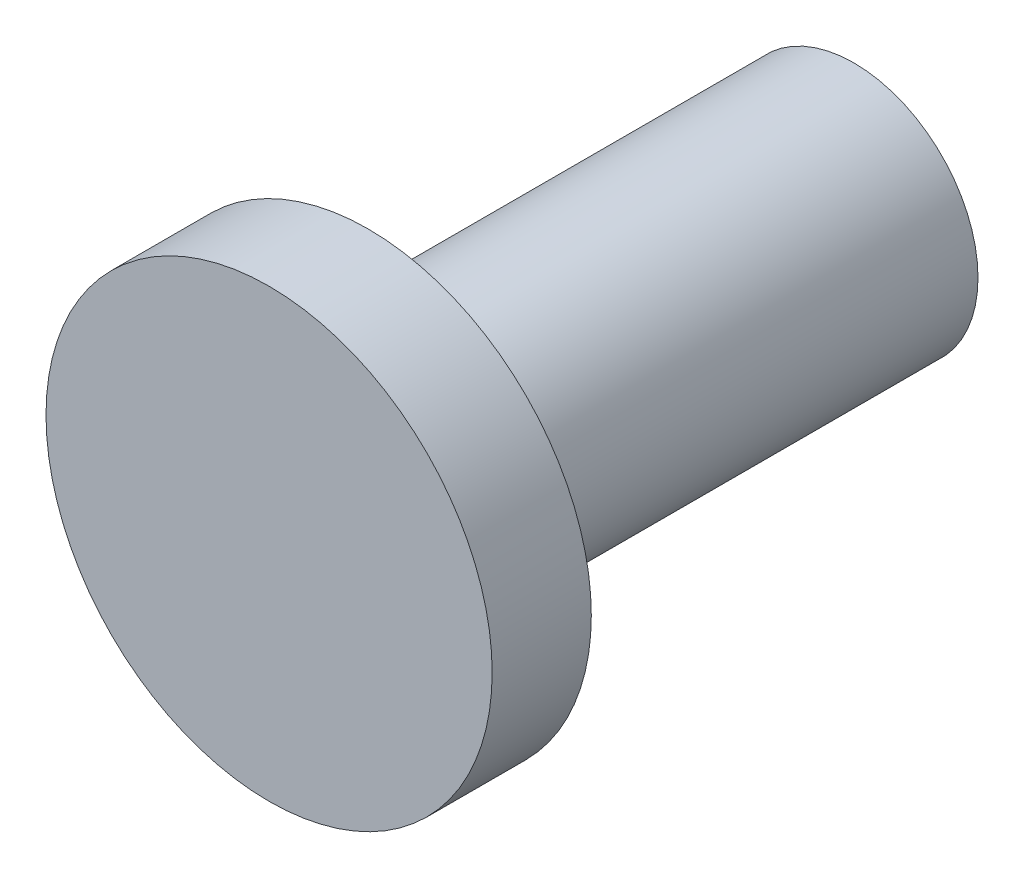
ISO-10303-21;
HEADER;
FILE_DESCRIPTION(('STEP AP214'),'2;1');
FILE_NAME('part.step','',(''),(''),'','','');
FILE_SCHEMA(('AUTOMOTIVE_DESIGN { 1 0 10303 214 1 1 1 1 }'));
ENDSEC;
DATA;
#1=APPLICATION_CONTEXT('core data for automotive mechanical design processes');
#2=APPLICATION_PROTOCOL_DEFINITION('international standard','automotive_design',2000,#1);
#3=PRODUCT_CONTEXT('',#1,'mechanical');
#4=PRODUCT('Part','Part','',(#3));
#5=PRODUCT_RELATED_PRODUCT_CATEGORY('part','',(#4));
#6=PRODUCT_DEFINITION_FORMATION('','',#4);
#7=PRODUCT_DEFINITION_CONTEXT('part definition',#1,'design');
#8=PRODUCT_DEFINITION('design','',#6,#7);
#9=PRODUCT_DEFINITION_SHAPE('','',#8);
#10=(LENGTH_UNIT() NAMED_UNIT(*) SI_UNIT(.MILLI.,.METRE.));
#11=(NAMED_UNIT(*) PLANE_ANGLE_UNIT() SI_UNIT($,.RADIAN.));
#12=(NAMED_UNIT(*) SI_UNIT($,.STERADIAN.) SOLID_ANGLE_UNIT());
#13=UNCERTAINTY_MEASURE_WITH_UNIT(LENGTH_MEASURE(1.E-05),#10,'distance_accuracy_value','');
#14=(GEOMETRIC_REPRESENTATION_CONTEXT(3) GLOBAL_UNCERTAINTY_ASSIGNED_CONTEXT((#13)) GLOBAL_UNIT_ASSIGNED_CONTEXT((#10,
#11,#12)) REPRESENTATION_CONTEXT('',''));
#15=CARTESIAN_POINT('',(0.,0.,0.));
#16=DIRECTION('',(0.,0.,1.));
#17=DIRECTION('',(1.,0.,0.));
#18=AXIS2_PLACEMENT_3D('',#15,#16,#17);
#19=CARTESIAN_POINT('',(0.,0.,-49.));
#20=DIRECTION('',(0.,0.,-1.));
#21=DIRECTION('',(0.,1.,0.));
#22=AXIS2_PLACEMENT_3D('',#19,#20,#21);
#23=PLANE('',#22);
#24=CARTESIAN_POINT('',(0.,0.,-49.));
#25=DIRECTION('',(0.,0.,-1.));
#26=DIRECTION('',(0.,1.,0.));
#27=AXIS2_PLACEMENT_3D('',#24,#25,#26);
#28=CIRCLE('',#27,12.5);
#29=CARTESIAN_POINT('',(0.,12.5,-49.));
#30=VERTEX_POINT('',#29);
#31=EDGE_CURVE('E8',#30,#30,#28,.T.);
#32=ORIENTED_EDGE('',*,*,#31,.T.);
#33=EDGE_LOOP('',(#32));
#34=FACE_BOUND('',#33,.T.);
#35=ADVANCED_FACE('F12',(#34),#23,.T.);
#36=CARTESIAN_POINT('',(0.,0.,-59.));
#37=DIRECTION('',(0.,0.,-1.));
#38=DIRECTION('',(0.,1.,0.));
#39=AXIS2_PLACEMENT_3D('',#36,#37,#38);
#40=CYLINDRICAL_SURFACE('',#39,12.5);
#41=CARTESIAN_POINT('',(0.,0.,0.));
#42=DIRECTION('',(0.,0.,-1.));
#43=DIRECTION('',(0.,1.,0.));
#44=AXIS2_PLACEMENT_3D('',#41,#42,#43);
#45=CIRCLE('',#44,12.5);
#46=CARTESIAN_POINT('',(0.,12.5,0.));
#47=VERTEX_POINT('',#46);
#48=EDGE_CURVE('E18',#47,#47,#45,.T.);
#49=ORIENTED_EDGE('',*,*,#48,.T.);
#50=EDGE_LOOP('',(#49));
#51=FACE_BOUND('',#50,.T.);
#52=ORIENTED_EDGE('',*,*,#31,.F.);
#53=EDGE_LOOP('',(#52));
#54=FACE_BOUND('',#53,.T.);
#55=ADVANCED_FACE('F45',(#51,#54),#40,.T.);
#56=CARTESIAN_POINT('',(12.5,0.,0.));
#57=DIRECTION('',(0.,0.,-1.));
#58=DIRECTION('',(0.,1.,0.));
#59=AXIS2_PLACEMENT_3D('',#56,#57,#58);
#60=PLANE('',#59);
#61=CARTESIAN_POINT('',(0.,0.,0.));
#62=DIRECTION('',(0.,0.,-1.));
#63=DIRECTION('',(0.,1.,0.));
#64=AXIS2_PLACEMENT_3D('',#61,#62,#63);
#65=CIRCLE('',#64,22.5);
#66=CARTESIAN_POINT('',(0.,22.5,0.));
#67=VERTEX_POINT('',#66);
#68=EDGE_CURVE('E22',#67,#67,#65,.T.);
#69=ORIENTED_EDGE('',*,*,#68,.T.);
#70=EDGE_LOOP('',(#69));
#71=FACE_BOUND('',#70,.T.);
#72=ORIENTED_EDGE('',*,*,#48,.F.);
#73=EDGE_LOOP('',(#72));
#74=FACE_BOUND('',#73,.T.);
#75=ADVANCED_FACE('F42',(#71,#74),#60,.T.);
#76=CARTESIAN_POINT('',(0.,0.,-59.));
#77=DIRECTION('',(0.,0.,-1.));
#78=DIRECTION('',(0.,1.,0.));
#79=AXIS2_PLACEMENT_3D('',#76,#77,#78);
#80=CYLINDRICAL_SURFACE('',#79,22.5);
#81=CARTESIAN_POINT('',(0.,0.,10.));
#82=DIRECTION('',(0.,0.,-1.));
#83=DIRECTION('',(0.,1.,0.));
#84=AXIS2_PLACEMENT_3D('',#81,#82,#83);
#85=CIRCLE('',#84,22.5);
#86=CARTESIAN_POINT('',(0.,22.5,10.));
#87=VERTEX_POINT('',#86);
#88=EDGE_CURVE('E26',#87,#87,#85,.T.);
#89=ORIENTED_EDGE('',*,*,#88,.T.);
#90=EDGE_LOOP('',(#89));
#91=FACE_BOUND('',#90,.T.);
#92=ORIENTED_EDGE('',*,*,#68,.F.);
#93=EDGE_LOOP('',(#92));
#94=FACE_BOUND('',#93,.T.);
#95=ADVANCED_FACE('F32',(#91,#94),#80,.T.);
#96=CARTESIAN_POINT('',(22.5,0.,10.));
#97=DIRECTION('',(0.,0.,1.));
#98=DIRECTION('',(0.,-1.,0.));
#99=AXIS2_PLACEMENT_3D('',#96,#97,#98);
#100=PLANE('',#99);
#101=ORIENTED_EDGE('',*,*,#88,.F.);
#102=EDGE_LOOP('',(#101));
#103=FACE_BOUND('',#102,.T.);
#104=ADVANCED_FACE('F35',(#103),#100,.T.);
#105=CLOSED_SHELL('',(#35,#55,#75,#95,#104));
#106=MANIFOLD_SOLID_BREP('B1',#105);
#107=ADVANCED_BREP_SHAPE_REPRESENTATION('',(#18,#106),#14);
#108=SHAPE_DEFINITION_REPRESENTATION(#9,#107);
ENDSEC;
END-ISO-10303-21;
